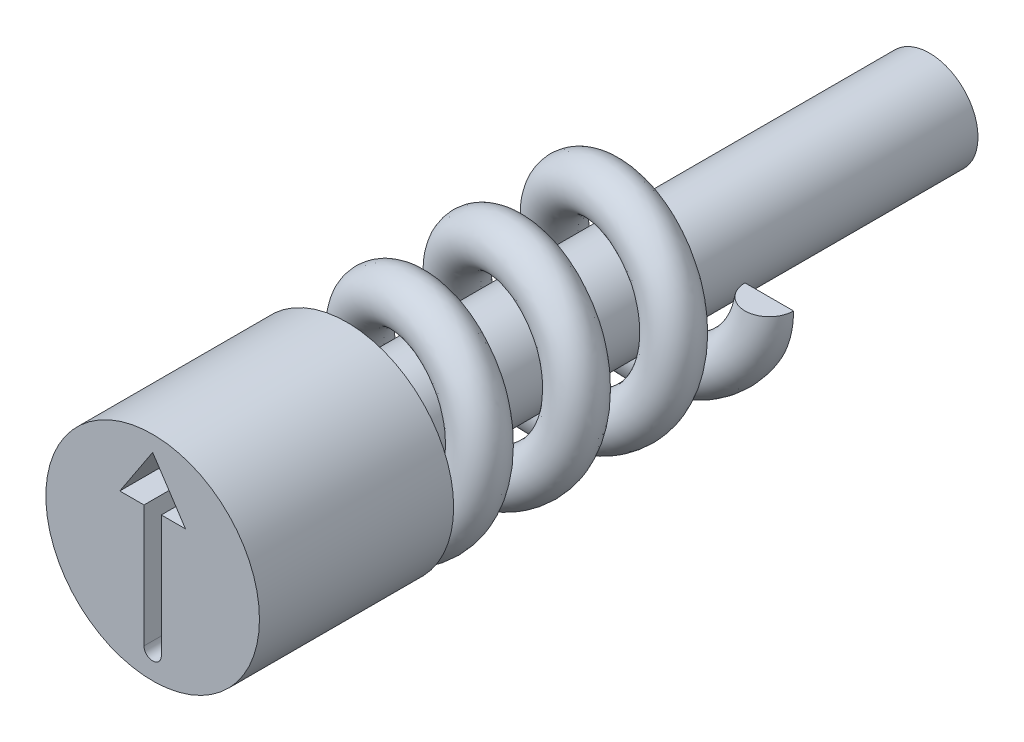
ISO-10303-21;
HEADER;
FILE_DESCRIPTION(('STEP AP214'),'2;1');
FILE_NAME('part.step','',(''),(''),'','','');
FILE_SCHEMA(('AUTOMOTIVE_DESIGN { 1 0 10303 214 1 1 1 1 }'));
ENDSEC;
DATA;
#1=APPLICATION_CONTEXT('core data for automotive mechanical design processes');
#2=APPLICATION_PROTOCOL_DEFINITION('international standard','automotive_design',2000,#1);
#3=PRODUCT_CONTEXT('',#1,'mechanical');
#4=PRODUCT('Part','Part','',(#3));
#5=PRODUCT_RELATED_PRODUCT_CATEGORY('part','',(#4));
#6=PRODUCT_DEFINITION_FORMATION('','',#4);
#7=PRODUCT_DEFINITION_CONTEXT('part definition',#1,'design');
#8=PRODUCT_DEFINITION('design','',#6,#7);
#9=PRODUCT_DEFINITION_SHAPE('','',#8);
#10=(LENGTH_UNIT() NAMED_UNIT(*) SI_UNIT(.MILLI.,.METRE.));
#11=(NAMED_UNIT(*) PLANE_ANGLE_UNIT() SI_UNIT($,.RADIAN.));
#12=(NAMED_UNIT(*) SI_UNIT($,.STERADIAN.) SOLID_ANGLE_UNIT());
#13=UNCERTAINTY_MEASURE_WITH_UNIT(LENGTH_MEASURE(1.E-05),#10,'distance_accuracy_value','');
#14=(GEOMETRIC_REPRESENTATION_CONTEXT(3) GLOBAL_UNCERTAINTY_ASSIGNED_CONTEXT((#13)) GLOBAL_UNIT_ASSIGNED_CONTEXT((#10,
#11,#12)) REPRESENTATION_CONTEXT('',''));
#15=CARTESIAN_POINT('',(0.,0.,0.));
#16=DIRECTION('',(0.,0.,1.));
#17=DIRECTION('',(1.,0.,0.));
#18=AXIS2_PLACEMENT_3D('',#15,#16,#17);
#19=CARTESIAN_POINT('',(0.85,0.,-5.75));
#20=DIRECTION('',(0.,-1.,0.));
#21=DIRECTION('',(0.,0.,-1.));
#22=AXIS2_PLACEMENT_3D('',#19,#20,#21);
#23=PLANE('',#22);
#24=CARTESIAN_POINT('',(0.85,0.,-5.5));
#25=DIRECTION('',(0.,1.,0.));
#26=DIRECTION('',(0.,0.,1.));
#27=AXIS2_PLACEMENT_3D('',#24,#25,#26);
#28=CIRCLE('',#27,0.25);
#29=CARTESIAN_POINT('',(0.6,-3.81647975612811E-13,-5.5));
#30=VERTEX_POINT('',#29);
#31=CARTESIAN_POINT('',(1.1,0.,-5.5));
#32=VERTEX_POINT('',#31);
#33=EDGE_CURVE('E88',#30,#32,#28,.T.);
#34=ORIENTED_EDGE('',*,*,#33,.T.);
#35=DIRECTION('',(-1.,0.,0.));
#36=VECTOR('',#35,1.);
#37=CARTESIAN_POINT('',(0.85,0.,-5.5));
#38=LINE('',#37,#36);
#39=EDGE_CURVE('E75',#32,#30,#38,.T.);
#40=ORIENTED_EDGE('',*,*,#39,.T.);
#41=EDGE_LOOP('',(#34,#40));
#42=FACE_BOUND('',#41,.T.);
#43=ADVANCED_FACE('F49',(#42),#23,.F.);
#44=CARTESIAN_POINT('',(-0.85,0.,-2.25));
#45=DIRECTION('',(0.,1.,0.));
#46=DIRECTION('',(-1.,0.,0.));
#47=AXIS2_PLACEMENT_3D('',#44,#45,#46);
#48=PLANE('',#47);
#49=DIRECTION('',(-1.,0.,0.));
#50=VECTOR('',#49,1.);
#51=CARTESIAN_POINT('',(-0.85,0.,-2.));
#52=LINE('',#51,#50);
#53=CARTESIAN_POINT('',(-0.6,0.,-2.));
#54=VERTEX_POINT('',#53);
#55=CARTESIAN_POINT('',(-1.1,0.,-2.));
#56=VERTEX_POINT('',#55);
#57=EDGE_CURVE('E69',#54,#56,#52,.T.);
#58=ORIENTED_EDGE('',*,*,#57,.F.);
#59=CARTESIAN_POINT('',(-0.85,0.,-2.));
#60=DIRECTION('',(0.,1.,0.));
#61=DIRECTION('',(-1.,0.,0.));
#62=AXIS2_PLACEMENT_3D('',#59,#60,#61);
#63=CIRCLE('',#62,0.25);
#64=EDGE_CURVE('E85',#54,#56,#63,.T.);
#65=ORIENTED_EDGE('',*,*,#64,.T.);
#66=EDGE_LOOP('',(#58,#65));
#67=FACE_BOUND('',#66,.T.);
#68=ADVANCED_FACE('F51',(#67),#48,.T.);
#69=CARTESIAN_POINT('',(0.85,0.,-5.25));
#70=CARTESIAN_POINT('',(0.85,-0.352081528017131,-5.1875));
#71=CARTESIAN_POINT('',(0.601040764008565,-0.601040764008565,-5.125));
#72=CARTESIAN_POINT('',(0.352081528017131,-0.85,-5.0625));
#73=CARTESIAN_POINT('',(0.,-0.85,-5.));
#74=CARTESIAN_POINT('',(-0.352081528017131,-0.85,-4.9375));
#75=CARTESIAN_POINT('',(-0.601040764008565,-0.601040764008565,-4.875));
#76=CARTESIAN_POINT('',(-0.85,-0.352081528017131,-4.8125));
#77=CARTESIAN_POINT('',(-0.85,0.,-4.75));
#78=CARTESIAN_POINT('',(-0.85,0.352081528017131,-4.6875));
#79=CARTESIAN_POINT('',(-0.601040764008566,0.601040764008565,-4.625));
#80=CARTESIAN_POINT('',(-0.352081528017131,0.85,-4.5625));
#81=CARTESIAN_POINT('',(0.,0.85,-4.5));
#82=CARTESIAN_POINT('',(0.352081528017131,0.85,-4.4375));
#83=CARTESIAN_POINT('',(0.601040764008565,0.601040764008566,-4.375));
#84=CARTESIAN_POINT('',(0.85,0.352081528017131,-4.3125));
#85=CARTESIAN_POINT('',(0.85,0.,-4.25));
#86=CARTESIAN_POINT('',(0.85,-0.352081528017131,-4.1875));
#87=CARTESIAN_POINT('',(0.601040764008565,-0.601040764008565,-4.125));
#88=CARTESIAN_POINT('',(0.352081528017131,-0.85,-4.0625));
#89=CARTESIAN_POINT('',(0.,-0.85,-4.));
#90=CARTESIAN_POINT('',(-0.352081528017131,-0.85,-3.9375));
#91=CARTESIAN_POINT('',(-0.601040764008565,-0.601040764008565,-3.875));
#92=CARTESIAN_POINT('',(-0.85,-0.352081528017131,-3.8125));
#93=CARTESIAN_POINT('',(-0.85,0.,-3.75));
#94=CARTESIAN_POINT('',(-0.85,0.352081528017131,-3.6875));
#95=CARTESIAN_POINT('',(-0.601040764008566,0.601040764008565,-3.625));
#96=CARTESIAN_POINT('',(-0.352081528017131,0.85,-3.5625));
#97=CARTESIAN_POINT('',(0.,0.85,-3.5));
#98=CARTESIAN_POINT('',(0.352081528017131,0.85,-3.4375));
#99=CARTESIAN_POINT('',(0.601040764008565,0.601040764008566,-3.375));
#100=CARTESIAN_POINT('',(0.85,0.352081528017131,-3.3125));
#101=CARTESIAN_POINT('',(0.85,0.,-3.25));
#102=CARTESIAN_POINT('',(0.85,-0.352081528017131,-3.1875));
#103=CARTESIAN_POINT('',(0.601040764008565,-0.601040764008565,-3.125));
#104=CARTESIAN_POINT('',(0.352081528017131,-0.85,-3.0625));
#105=CARTESIAN_POINT('',(0.,-0.85,-3.));
#106=CARTESIAN_POINT('',(-0.352081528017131,-0.85,-2.9375));
#107=CARTESIAN_POINT('',(-0.601040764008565,-0.601040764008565,-2.875));
#108=CARTESIAN_POINT('',(-0.85,-0.352081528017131,-2.8125));
#109=CARTESIAN_POINT('',(-0.85,0.,-2.75));
#110=CARTESIAN_POINT('',(-0.85,0.352081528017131,-2.6875));
#111=CARTESIAN_POINT('',(-0.601040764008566,0.601040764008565,-2.625));
#112=CARTESIAN_POINT('',(-0.352081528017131,0.85,-2.5625));
#113=CARTESIAN_POINT('',(0.,0.85,-2.5));
#114=CARTESIAN_POINT('',(0.352081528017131,0.85,-2.4375));
#115=CARTESIAN_POINT('',(0.601040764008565,0.601040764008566,-2.375));
#116=CARTESIAN_POINT('',(0.85,0.352081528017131,-2.3125));
#117=CARTESIAN_POINT('',(0.85,0.,-2.25));
#118=CARTESIAN_POINT('',(0.85,-0.352081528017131,-2.1875));
#119=CARTESIAN_POINT('',(0.601040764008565,-0.601040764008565,-2.125));
#120=CARTESIAN_POINT('',(0.352081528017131,-0.85,-2.0625));
#121=CARTESIAN_POINT('',(0.,-0.85,-2.));
#122=CARTESIAN_POINT('',(-0.352081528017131,-0.85,-1.9375));
#123=CARTESIAN_POINT('',(-0.601040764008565,-0.601040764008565,-1.875));
#124=CARTESIAN_POINT('',(-0.85,-0.352081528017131,-1.8125));
#125=CARTESIAN_POINT('',(-0.85,0.,-1.75));
#126=CARTESIAN_POINT('',(1.35,0.,-5.25));
#127=CARTESIAN_POINT('',(1.35,-0.559188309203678,-5.1875));
#128=CARTESIAN_POINT('',(0.954594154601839,-0.954594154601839,-5.125));
#129=CARTESIAN_POINT('',(0.559188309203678,-1.35,-5.0625));
#130=CARTESIAN_POINT('',(0.,-1.35,-5.));
#131=CARTESIAN_POINT('',(-0.559188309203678,-1.35,-4.9375));
#132=CARTESIAN_POINT('',(-0.954594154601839,-0.954594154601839,-4.875));
#133=CARTESIAN_POINT('',(-1.35,-0.559188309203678,-4.8125));
#134=CARTESIAN_POINT('',(-1.35,0.,-4.75));
#135=CARTESIAN_POINT('',(-1.35,0.559188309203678,-4.6875));
#136=CARTESIAN_POINT('',(-0.954594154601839,0.954594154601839,-4.625));
#137=CARTESIAN_POINT('',(-0.559188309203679,1.35,-4.5625));
#138=CARTESIAN_POINT('',(0.,1.35,-4.5));
#139=CARTESIAN_POINT('',(0.559188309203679,1.35,-4.4375));
#140=CARTESIAN_POINT('',(0.954594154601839,0.954594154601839,-4.375));
#141=CARTESIAN_POINT('',(1.35,0.559188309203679,-4.3125));
#142=CARTESIAN_POINT('',(1.35,0.,-4.25));
#143=CARTESIAN_POINT('',(1.35,-0.559188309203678,-4.1875));
#144=CARTESIAN_POINT('',(0.954594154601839,-0.954594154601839,-4.125));
#145=CARTESIAN_POINT('',(0.559188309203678,-1.35,-4.0625));
#146=CARTESIAN_POINT('',(0.,-1.35,-4.));
#147=CARTESIAN_POINT('',(-0.559188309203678,-1.35,-3.9375));
#148=CARTESIAN_POINT('',(-0.954594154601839,-0.954594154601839,-3.875));
#149=CARTESIAN_POINT('',(-1.35,-0.559188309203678,-3.8125));
#150=CARTESIAN_POINT('',(-1.35,0.,-3.75));
#151=CARTESIAN_POINT('',(-1.35,0.559188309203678,-3.6875));
#152=CARTESIAN_POINT('',(-0.954594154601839,0.954594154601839,-3.625));
#153=CARTESIAN_POINT('',(-0.559188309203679,1.35,-3.5625));
#154=CARTESIAN_POINT('',(0.,1.35,-3.5));
#155=CARTESIAN_POINT('',(0.559188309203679,1.35,-3.4375));
#156=CARTESIAN_POINT('',(0.954594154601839,0.954594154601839,-3.375));
#157=CARTESIAN_POINT('',(1.35,0.559188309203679,-3.3125));
#158=CARTESIAN_POINT('',(1.35,0.,-3.25));
#159=CARTESIAN_POINT('',(1.35,-0.559188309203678,-3.1875));
#160=CARTESIAN_POINT('',(0.954594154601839,-0.954594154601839,-3.125));
#161=CARTESIAN_POINT('',(0.559188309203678,-1.35,-3.0625));
#162=CARTESIAN_POINT('',(0.,-1.35,-3.));
#163=CARTESIAN_POINT('',(-0.559188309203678,-1.35,-2.9375));
#164=CARTESIAN_POINT('',(-0.954594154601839,-0.954594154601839,-2.875));
#165=CARTESIAN_POINT('',(-1.35,-0.559188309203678,-2.8125));
#166=CARTESIAN_POINT('',(-1.35,0.,-2.75));
#167=CARTESIAN_POINT('',(-1.35,0.559188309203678,-2.6875));
#168=CARTESIAN_POINT('',(-0.954594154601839,0.954594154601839,-2.625));
#169=CARTESIAN_POINT('',(-0.559188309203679,1.35,-2.5625));
#170=CARTESIAN_POINT('',(0.,1.35,-2.5));
#171=CARTESIAN_POINT('',(0.559188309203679,1.35,-2.4375));
#172=CARTESIAN_POINT('',(0.954594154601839,0.954594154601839,-2.375));
#173=CARTESIAN_POINT('',(1.35,0.559188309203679,-2.3125));
#174=CARTESIAN_POINT('',(1.35,0.,-2.25));
#175=CARTESIAN_POINT('',(1.35,-0.559188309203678,-2.1875));
#176=CARTESIAN_POINT('',(0.954594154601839,-0.954594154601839,-2.125));
#177=CARTESIAN_POINT('',(0.559188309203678,-1.35,-2.0625));
#178=CARTESIAN_POINT('',(0.,-1.35,-2.));
#179=CARTESIAN_POINT('',(-0.559188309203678,-1.35,-1.9375));
#180=CARTESIAN_POINT('',(-0.954594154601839,-0.954594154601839,-1.875));
#181=CARTESIAN_POINT('',(-1.35,-0.559188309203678,-1.8125));
#182=CARTESIAN_POINT('',(-1.35,0.,-1.75));
#183=CARTESIAN_POINT('',(1.35,0.,-5.75));
#184=CARTESIAN_POINT('',(1.35,-0.559188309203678,-5.6875));
#185=CARTESIAN_POINT('',(0.954594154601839,-0.954594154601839,-5.625));
#186=CARTESIAN_POINT('',(0.559188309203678,-1.35,-5.5625));
#187=CARTESIAN_POINT('',(0.,-1.35,-5.5));
#188=CARTESIAN_POINT('',(-0.559188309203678,-1.35,-5.4375));
#189=CARTESIAN_POINT('',(-0.954594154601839,-0.954594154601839,-5.375));
#190=CARTESIAN_POINT('',(-1.35,-0.559188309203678,-5.3125));
#191=CARTESIAN_POINT('',(-1.35,0.,-5.25));
#192=CARTESIAN_POINT('',(-1.35,0.559188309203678,-5.1875));
#193=CARTESIAN_POINT('',(-0.954594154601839,0.954594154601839,-5.125));
#194=CARTESIAN_POINT('',(-0.559188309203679,1.35,-5.0625));
#195=CARTESIAN_POINT('',(0.,1.35,-5.));
#196=CARTESIAN_POINT('',(0.559188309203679,1.35,-4.9375));
#197=CARTESIAN_POINT('',(0.954594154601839,0.954594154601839,-4.875));
#198=CARTESIAN_POINT('',(1.35,0.559188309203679,-4.8125));
#199=CARTESIAN_POINT('',(1.35,0.,-4.75));
#200=CARTESIAN_POINT('',(1.35,-0.559188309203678,-4.6875));
#201=CARTESIAN_POINT('',(0.954594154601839,-0.954594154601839,-4.625));
#202=CARTESIAN_POINT('',(0.559188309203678,-1.35,-4.5625));
#203=CARTESIAN_POINT('',(0.,-1.35,-4.5));
#204=CARTESIAN_POINT('',(-0.559188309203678,-1.35,-4.4375));
#205=CARTESIAN_POINT('',(-0.954594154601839,-0.954594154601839,-4.375));
#206=CARTESIAN_POINT('',(-1.35,-0.559188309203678,-4.3125));
#207=CARTESIAN_POINT('',(-1.35,0.,-4.25));
#208=CARTESIAN_POINT('',(-1.35,0.559188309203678,-4.1875));
#209=CARTESIAN_POINT('',(-0.954594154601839,0.954594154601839,-4.125));
#210=CARTESIAN_POINT('',(-0.559188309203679,1.35,-4.0625));
#211=CARTESIAN_POINT('',(0.,1.35,-4.));
#212=CARTESIAN_POINT('',(0.559188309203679,1.35,-3.9375));
#213=CARTESIAN_POINT('',(0.954594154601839,0.954594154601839,-3.875));
#214=CARTESIAN_POINT('',(1.35,0.559188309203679,-3.8125));
#215=CARTESIAN_POINT('',(1.35,0.,-3.75));
#216=CARTESIAN_POINT('',(1.35,-0.559188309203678,-3.6875));
#217=CARTESIAN_POINT('',(0.954594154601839,-0.954594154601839,-3.625));
#218=CARTESIAN_POINT('',(0.559188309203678,-1.35,-3.5625));
#219=CARTESIAN_POINT('',(0.,-1.35,-3.5));
#220=CARTESIAN_POINT('',(-0.559188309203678,-1.35,-3.4375));
#221=CARTESIAN_POINT('',(-0.954594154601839,-0.954594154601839,-3.375));
#222=CARTESIAN_POINT('',(-1.35,-0.559188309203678,-3.3125));
#223=CARTESIAN_POINT('',(-1.35,0.,-3.25));
#224=CARTESIAN_POINT('',(-1.35,0.559188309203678,-3.1875));
#225=CARTESIAN_POINT('',(-0.954594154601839,0.954594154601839,-3.125));
#226=CARTESIAN_POINT('',(-0.559188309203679,1.35,-3.0625));
#227=CARTESIAN_POINT('',(0.,1.35,-3.));
#228=CARTESIAN_POINT('',(0.559188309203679,1.35,-2.9375));
#229=CARTESIAN_POINT('',(0.954594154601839,0.954594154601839,-2.875));
#230=CARTESIAN_POINT('',(1.35,0.559188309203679,-2.8125));
#231=CARTESIAN_POINT('',(1.35,0.,-2.75));
#232=CARTESIAN_POINT('',(1.35,-0.559188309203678,-2.6875));
#233=CARTESIAN_POINT('',(0.954594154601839,-0.954594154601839,-2.625));
#234=CARTESIAN_POINT('',(0.559188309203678,-1.35,-2.5625));
#235=CARTESIAN_POINT('',(0.,-1.35,-2.5));
#236=CARTESIAN_POINT('',(-0.559188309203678,-1.35,-2.4375));
#237=CARTESIAN_POINT('',(-0.954594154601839,-0.954594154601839,-2.375));
#238=CARTESIAN_POINT('',(-1.35,-0.559188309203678,-2.3125));
#239=CARTESIAN_POINT('',(-1.35,0.,-2.25));
#240=CARTESIAN_POINT('',(0.85,0.,-5.75));
#241=CARTESIAN_POINT('',(0.85,-0.352081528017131,-5.6875));
#242=CARTESIAN_POINT('',(0.601040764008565,-0.601040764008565,-5.625));
#243=CARTESIAN_POINT('',(0.352081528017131,-0.85,-5.5625));
#244=CARTESIAN_POINT('',(0.,-0.85,-5.5));
#245=CARTESIAN_POINT('',(-0.352081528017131,-0.85,-5.4375));
#246=CARTESIAN_POINT('',(-0.601040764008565,-0.601040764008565,-5.375));
#247=CARTESIAN_POINT('',(-0.85,-0.352081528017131,-5.3125));
#248=CARTESIAN_POINT('',(-0.85,0.,-5.25));
#249=CARTESIAN_POINT('',(-0.85,0.352081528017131,-5.1875));
#250=CARTESIAN_POINT('',(-0.601040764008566,0.601040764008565,-5.125));
#251=CARTESIAN_POINT('',(-0.352081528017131,0.85,-5.0625));
#252=CARTESIAN_POINT('',(0.,0.85,-5.));
#253=CARTESIAN_POINT('',(0.352081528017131,0.85,-4.9375));
#254=CARTESIAN_POINT('',(0.601040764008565,0.601040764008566,-4.875));
#255=CARTESIAN_POINT('',(0.85,0.352081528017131,-4.8125));
#256=CARTESIAN_POINT('',(0.85,0.,-4.75));
#257=CARTESIAN_POINT('',(0.85,-0.352081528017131,-4.6875));
#258=CARTESIAN_POINT('',(0.601040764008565,-0.601040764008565,-4.625));
#259=CARTESIAN_POINT('',(0.352081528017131,-0.85,-4.5625));
#260=CARTESIAN_POINT('',(0.,-0.85,-4.5));
#261=CARTESIAN_POINT('',(-0.352081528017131,-0.85,-4.4375));
#262=CARTESIAN_POINT('',(-0.601040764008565,-0.601040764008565,-4.375));
#263=CARTESIAN_POINT('',(-0.85,-0.352081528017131,-4.3125));
#264=CARTESIAN_POINT('',(-0.85,0.,-4.25));
#265=CARTESIAN_POINT('',(-0.85,0.352081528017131,-4.1875));
#266=CARTESIAN_POINT('',(-0.601040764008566,0.601040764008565,-4.125));
#267=CARTESIAN_POINT('',(-0.352081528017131,0.85,-4.0625));
#268=CARTESIAN_POINT('',(0.,0.85,-4.));
#269=CARTESIAN_POINT('',(0.352081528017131,0.85,-3.9375));
#270=CARTESIAN_POINT('',(0.601040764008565,0.601040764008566,-3.875));
#271=CARTESIAN_POINT('',(0.85,0.352081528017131,-3.8125));
#272=CARTESIAN_POINT('',(0.85,0.,-3.75));
#273=CARTESIAN_POINT('',(0.85,-0.352081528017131,-3.6875));
#274=CARTESIAN_POINT('',(0.601040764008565,-0.601040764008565,-3.625));
#275=CARTESIAN_POINT('',(0.352081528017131,-0.85,-3.5625));
#276=CARTESIAN_POINT('',(0.,-0.85,-3.5));
#277=CARTESIAN_POINT('',(-0.352081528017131,-0.85,-3.4375));
#278=CARTESIAN_POINT('',(-0.601040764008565,-0.601040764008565,-3.375));
#279=CARTESIAN_POINT('',(-0.85,-0.352081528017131,-3.3125));
#280=CARTESIAN_POINT('',(-0.85,0.,-3.25));
#281=CARTESIAN_POINT('',(-0.85,0.352081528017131,-3.1875));
#282=CARTESIAN_POINT('',(-0.601040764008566,0.601040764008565,-3.125));
#283=CARTESIAN_POINT('',(-0.352081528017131,0.85,-3.0625));
#284=CARTESIAN_POINT('',(0.,0.85,-3.));
#285=CARTESIAN_POINT('',(0.352081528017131,0.85,-2.9375));
#286=CARTESIAN_POINT('',(0.601040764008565,0.601040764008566,-2.875));
#287=CARTESIAN_POINT('',(0.85,0.352081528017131,-2.8125));
#288=CARTESIAN_POINT('',(0.85,0.,-2.75));
#289=CARTESIAN_POINT('',(0.85,-0.352081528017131,-2.6875));
#290=CARTESIAN_POINT('',(0.601040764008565,-0.601040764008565,-2.625));
#291=CARTESIAN_POINT('',(0.352081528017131,-0.85,-2.5625));
#292=CARTESIAN_POINT('',(0.,-0.85,-2.5));
#293=CARTESIAN_POINT('',(-0.352081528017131,-0.85,-2.4375));
#294=CARTESIAN_POINT('',(-0.601040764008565,-0.601040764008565,-2.375));
#295=CARTESIAN_POINT('',(-0.85,-0.352081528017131,-2.3125));
#296=CARTESIAN_POINT('',(-0.85,0.,-2.25));
#297=CARTESIAN_POINT('',(0.35,0.,-5.75));
#298=CARTESIAN_POINT('',(0.35,-0.144974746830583,-5.6875));
#299=CARTESIAN_POINT('',(0.247487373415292,-0.247487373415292,-5.625));
#300=CARTESIAN_POINT('',(0.144974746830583,-0.35,-5.5625));
#301=CARTESIAN_POINT('',(0.,-0.35,-5.5));
#302=CARTESIAN_POINT('',(-0.144974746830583,-0.35,-5.4375));
#303=CARTESIAN_POINT('',(-0.247487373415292,-0.247487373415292,-5.375));
#304=CARTESIAN_POINT('',(-0.35,-0.144974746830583,-5.3125));
#305=CARTESIAN_POINT('',(-0.35,0.,-5.25));
#306=CARTESIAN_POINT('',(-0.35,0.144974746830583,-5.1875));
#307=CARTESIAN_POINT('',(-0.247487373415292,0.247487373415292,-5.125));
#308=CARTESIAN_POINT('',(-0.144974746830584,0.35,-5.0625));
#309=CARTESIAN_POINT('',(0.,0.35,-5.));
#310=CARTESIAN_POINT('',(0.144974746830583,0.35,-4.9375));
#311=CARTESIAN_POINT('',(0.247487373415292,0.247487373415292,-4.875));
#312=CARTESIAN_POINT('',(0.35,0.144974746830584,-4.8125));
#313=CARTESIAN_POINT('',(0.35,0.,-4.75));
#314=CARTESIAN_POINT('',(0.35,-0.144974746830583,-4.6875));
#315=CARTESIAN_POINT('',(0.247487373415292,-0.247487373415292,-4.625));
#316=CARTESIAN_POINT('',(0.144974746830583,-0.35,-4.5625));
#317=CARTESIAN_POINT('',(0.,-0.35,-4.5));
#318=CARTESIAN_POINT('',(-0.144974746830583,-0.35,-4.4375));
#319=CARTESIAN_POINT('',(-0.247487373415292,-0.247487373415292,-4.375));
#320=CARTESIAN_POINT('',(-0.35,-0.144974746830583,-4.3125));
#321=CARTESIAN_POINT('',(-0.35,0.,-4.25));
#322=CARTESIAN_POINT('',(-0.35,0.144974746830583,-4.1875));
#323=CARTESIAN_POINT('',(-0.247487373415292,0.247487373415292,-4.125));
#324=CARTESIAN_POINT('',(-0.144974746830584,0.35,-4.0625));
#325=CARTESIAN_POINT('',(0.,0.35,-4.));
#326=CARTESIAN_POINT('',(0.144974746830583,0.35,-3.9375));
#327=CARTESIAN_POINT('',(0.247487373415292,0.247487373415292,-3.875));
#328=CARTESIAN_POINT('',(0.35,0.144974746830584,-3.8125));
#329=CARTESIAN_POINT('',(0.35,0.,-3.75));
#330=CARTESIAN_POINT('',(0.35,-0.144974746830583,-3.6875));
#331=CARTESIAN_POINT('',(0.247487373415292,-0.247487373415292,-3.625));
#332=CARTESIAN_POINT('',(0.144974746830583,-0.35,-3.5625));
#333=CARTESIAN_POINT('',(0.,-0.35,-3.5));
#334=CARTESIAN_POINT('',(-0.144974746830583,-0.35,-3.4375));
#335=CARTESIAN_POINT('',(-0.247487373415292,-0.247487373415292,-3.375));
#336=CARTESIAN_POINT('',(-0.35,-0.144974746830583,-3.3125));
#337=CARTESIAN_POINT('',(-0.35,0.,-3.25));
#338=CARTESIAN_POINT('',(-0.35,0.144974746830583,-3.1875));
#339=CARTESIAN_POINT('',(-0.247487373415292,0.247487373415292,-3.125));
#340=CARTESIAN_POINT('',(-0.144974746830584,0.35,-3.0625));
#341=CARTESIAN_POINT('',(0.,0.35,-3.));
#342=CARTESIAN_POINT('',(0.144974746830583,0.35,-2.9375));
#343=CARTESIAN_POINT('',(0.247487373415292,0.247487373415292,-2.875));
#344=CARTESIAN_POINT('',(0.35,0.144974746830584,-2.8125));
#345=CARTESIAN_POINT('',(0.35,0.,-2.75));
#346=CARTESIAN_POINT('',(0.35,-0.144974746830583,-2.6875));
#347=CARTESIAN_POINT('',(0.247487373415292,-0.247487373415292,-2.625));
#348=CARTESIAN_POINT('',(0.144974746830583,-0.35,-2.5625));
#349=CARTESIAN_POINT('',(0.,-0.35,-2.5));
#350=CARTESIAN_POINT('',(-0.144974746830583,-0.35,-2.4375));
#351=CARTESIAN_POINT('',(-0.247487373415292,-0.247487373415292,-2.375));
#352=CARTESIAN_POINT('',(-0.35,-0.144974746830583,-2.3125));
#353=CARTESIAN_POINT('',(-0.35,0.,-2.25));
#354=CARTESIAN_POINT('',(0.35,0.,-5.25));
#355=CARTESIAN_POINT('',(0.35,-0.144974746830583,-5.1875));
#356=CARTESIAN_POINT('',(0.247487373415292,-0.247487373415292,-5.125));
#357=CARTESIAN_POINT('',(0.144974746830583,-0.35,-5.0625));
#358=CARTESIAN_POINT('',(0.,-0.35,-5.));
#359=CARTESIAN_POINT('',(-0.144974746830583,-0.35,-4.9375));
#360=CARTESIAN_POINT('',(-0.247487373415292,-0.247487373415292,-4.875));
#361=CARTESIAN_POINT('',(-0.35,-0.144974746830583,-4.8125));
#362=CARTESIAN_POINT('',(-0.35,0.,-4.75));
#363=CARTESIAN_POINT('',(-0.35,0.144974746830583,-4.6875));
#364=CARTESIAN_POINT('',(-0.247487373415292,0.247487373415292,-4.625));
#365=CARTESIAN_POINT('',(-0.144974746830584,0.35,-4.5625));
#366=CARTESIAN_POINT('',(0.,0.35,-4.5));
#367=CARTESIAN_POINT('',(0.144974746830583,0.35,-4.4375));
#368=CARTESIAN_POINT('',(0.247487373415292,0.247487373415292,-4.375));
#369=CARTESIAN_POINT('',(0.35,0.144974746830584,-4.3125));
#370=CARTESIAN_POINT('',(0.35,0.,-4.25));
#371=CARTESIAN_POINT('',(0.35,-0.144974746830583,-4.1875));
#372=CARTESIAN_POINT('',(0.247487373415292,-0.247487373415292,-4.125));
#373=CARTESIAN_POINT('',(0.144974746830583,-0.35,-4.0625));
#374=CARTESIAN_POINT('',(0.,-0.35,-4.));
#375=CARTESIAN_POINT('',(-0.144974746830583,-0.35,-3.9375));
#376=CARTESIAN_POINT('',(-0.247487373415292,-0.247487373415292,-3.875));
#377=CARTESIAN_POINT('',(-0.35,-0.144974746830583,-3.8125));
#378=CARTESIAN_POINT('',(-0.35,0.,-3.75));
#379=CARTESIAN_POINT('',(-0.35,0.144974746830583,-3.6875));
#380=CARTESIAN_POINT('',(-0.247487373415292,0.247487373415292,-3.625));
#381=CARTESIAN_POINT('',(-0.144974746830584,0.35,-3.5625));
#382=CARTESIAN_POINT('',(0.,0.35,-3.5));
#383=CARTESIAN_POINT('',(0.144974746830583,0.35,-3.4375));
#384=CARTESIAN_POINT('',(0.247487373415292,0.247487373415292,-3.375));
#385=CARTESIAN_POINT('',(0.35,0.144974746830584,-3.3125));
#386=CARTESIAN_POINT('',(0.35,0.,-3.25));
#387=CARTESIAN_POINT('',(0.35,-0.144974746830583,-3.1875));
#388=CARTESIAN_POINT('',(0.247487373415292,-0.247487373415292,-3.125));
#389=CARTESIAN_POINT('',(0.144974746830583,-0.35,-3.0625));
#390=CARTESIAN_POINT('',(0.,-0.35,-3.));
#391=CARTESIAN_POINT('',(-0.144974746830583,-0.35,-2.9375));
#392=CARTESIAN_POINT('',(-0.247487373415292,-0.247487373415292,-2.875));
#393=CARTESIAN_POINT('',(-0.35,-0.144974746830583,-2.8125));
#394=CARTESIAN_POINT('',(-0.35,0.,-2.75));
#395=CARTESIAN_POINT('',(-0.35,0.144974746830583,-2.6875));
#396=CARTESIAN_POINT('',(-0.247487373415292,0.247487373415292,-2.625));
#397=CARTESIAN_POINT('',(-0.144974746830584,0.35,-2.5625));
#398=CARTESIAN_POINT('',(0.,0.35,-2.5));
#399=CARTESIAN_POINT('',(0.144974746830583,0.35,-2.4375));
#400=CARTESIAN_POINT('',(0.247487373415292,0.247487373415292,-2.375));
#401=CARTESIAN_POINT('',(0.35,0.144974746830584,-2.3125));
#402=CARTESIAN_POINT('',(0.35,0.,-2.25));
#403=CARTESIAN_POINT('',(0.35,-0.144974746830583,-2.1875));
#404=CARTESIAN_POINT('',(0.247487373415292,-0.247487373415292,-2.125));
#405=CARTESIAN_POINT('',(0.144974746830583,-0.35,-2.0625));
#406=CARTESIAN_POINT('',(0.,-0.35,-2.));
#407=CARTESIAN_POINT('',(-0.144974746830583,-0.35,-1.9375));
#408=CARTESIAN_POINT('',(-0.247487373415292,-0.247487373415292,-1.875));
#409=CARTESIAN_POINT('',(-0.35,-0.144974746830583,-1.8125));
#410=CARTESIAN_POINT('',(-0.35,0.,-1.75));
#411=CARTESIAN_POINT('',(0.85,0.,-5.25));
#412=CARTESIAN_POINT('',(0.85,-0.352081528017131,-5.1875));
#413=CARTESIAN_POINT('',(0.601040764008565,-0.601040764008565,-5.125));
#414=CARTESIAN_POINT('',(0.352081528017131,-0.85,-5.0625));
#415=CARTESIAN_POINT('',(0.,-0.85,-5.));
#416=CARTESIAN_POINT('',(-0.352081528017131,-0.85,-4.9375));
#417=CARTESIAN_POINT('',(-0.601040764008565,-0.601040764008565,-4.875));
#418=CARTESIAN_POINT('',(-0.85,-0.352081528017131,-4.8125));
#419=CARTESIAN_POINT('',(-0.85,0.,-4.75));
#420=CARTESIAN_POINT('',(-0.85,0.352081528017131,-4.6875));
#421=CARTESIAN_POINT('',(-0.601040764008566,0.601040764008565,-4.625));
#422=CARTESIAN_POINT('',(-0.352081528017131,0.85,-4.5625));
#423=CARTESIAN_POINT('',(0.,0.85,-4.5));
#424=CARTESIAN_POINT('',(0.352081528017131,0.85,-4.4375));
#425=CARTESIAN_POINT('',(0.601040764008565,0.601040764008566,-4.375));
#426=CARTESIAN_POINT('',(0.85,0.352081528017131,-4.3125));
#427=CARTESIAN_POINT('',(0.85,0.,-4.25));
#428=CARTESIAN_POINT('',(0.85,-0.352081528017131,-4.1875));
#429=CARTESIAN_POINT('',(0.601040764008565,-0.601040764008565,-4.125));
#430=CARTESIAN_POINT('',(0.352081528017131,-0.85,-4.0625));
#431=CARTESIAN_POINT('',(0.,-0.85,-4.));
#432=CARTESIAN_POINT('',(-0.352081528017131,-0.85,-3.9375));
#433=CARTESIAN_POINT('',(-0.601040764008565,-0.601040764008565,-3.875));
#434=CARTESIAN_POINT('',(-0.85,-0.352081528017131,-3.8125));
#435=CARTESIAN_POINT('',(-0.85,0.,-3.75));
#436=CARTESIAN_POINT('',(-0.85,0.352081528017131,-3.6875));
#437=CARTESIAN_POINT('',(-0.601040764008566,0.601040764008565,-3.625));
#438=CARTESIAN_POINT('',(-0.352081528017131,0.85,-3.5625));
#439=CARTESIAN_POINT('',(0.,0.85,-3.5));
#440=CARTESIAN_POINT('',(0.352081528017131,0.85,-3.4375));
#441=CARTESIAN_POINT('',(0.601040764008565,0.601040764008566,-3.375));
#442=CARTESIAN_POINT('',(0.85,0.352081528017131,-3.3125));
#443=CARTESIAN_POINT('',(0.85,0.,-3.25));
#444=CARTESIAN_POINT('',(0.85,-0.352081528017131,-3.1875));
#445=CARTESIAN_POINT('',(0.601040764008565,-0.601040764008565,-3.125));
#446=CARTESIAN_POINT('',(0.352081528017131,-0.85,-3.0625));
#447=CARTESIAN_POINT('',(0.,-0.85,-3.));
#448=CARTESIAN_POINT('',(-0.352081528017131,-0.85,-2.9375));
#449=CARTESIAN_POINT('',(-0.601040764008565,-0.601040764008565,-2.875));
#450=CARTESIAN_POINT('',(-0.85,-0.352081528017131,-2.8125));
#451=CARTESIAN_POINT('',(-0.85,0.,-2.75));
#452=CARTESIAN_POINT('',(-0.85,0.352081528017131,-2.6875));
#453=CARTESIAN_POINT('',(-0.601040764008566,0.601040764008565,-2.625));
#454=CARTESIAN_POINT('',(-0.352081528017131,0.85,-2.5625));
#455=CARTESIAN_POINT('',(0.,0.85,-2.5));
#456=CARTESIAN_POINT('',(0.352081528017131,0.85,-2.4375));
#457=CARTESIAN_POINT('',(0.601040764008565,0.601040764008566,-2.375));
#458=CARTESIAN_POINT('',(0.85,0.352081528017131,-2.3125));
#459=CARTESIAN_POINT('',(0.85,0.,-2.25));
#460=CARTESIAN_POINT('',(0.85,-0.352081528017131,-2.1875));
#461=CARTESIAN_POINT('',(0.601040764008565,-0.601040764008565,-2.125));
#462=CARTESIAN_POINT('',(0.352081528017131,-0.85,-2.0625));
#463=CARTESIAN_POINT('',(0.,-0.85,-2.));
#464=CARTESIAN_POINT('',(-0.352081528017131,-0.85,-1.9375));
#465=CARTESIAN_POINT('',(-0.601040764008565,-0.601040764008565,-1.875));
#466=CARTESIAN_POINT('',(-0.85,-0.352081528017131,-1.8125));
#467=CARTESIAN_POINT('',(-0.85,0.,-1.75));
#468=(BOUNDED_SURFACE() B_SPLINE_SURFACE(3,2,((#69,#70,#71,#72,#73,#74,#75,#76,#77,#78,#79,#80,
#81,#82,#83,#84,#85,#86,#87,#88,#89,#90,#91,#92,#93,#94,#95,#96,#97,#98,#99,#100,#101,#102,#103,
#104,#105,#106,#107,#108,#109,#110,#111,#112,#113,#114,#115,#116,#117,#118,#119,#120,#121,#122,
#123,#124,#125),(#126,#127,#128,#129,#130,#131,#132,#133,#134,#135,#136,#137,#138,#139,#140,
#141,#142,#143,#144,#145,#146,#147,#148,#149,#150,#151,#152,#153,#154,#155,#156,#157,#158,#159,
#160,#161,#162,#163,#164,#165,#166,#167,#168,#169,#170,#171,#172,#173,#174,#175,#176,#177,#178,
#179,#180,#181,#182),(#183,#184,#185,#186,#187,#188,#189,#190,#191,#192,#193,#194,#195,#196,
#197,#198,#199,#200,#201,#202,#203,#204,#205,#206,#207,#208,#209,#210,#211,#212,#213,#214,#215,
#216,#217,#218,#219,#220,#221,#222,#223,#224,#225,#226,#227,#228,#229,#230,#231,#232,#233,#234,
#235,#236,#237,#238,#239),(#240,#241,#242,#243,#244,#245,#246,#247,#248,#249,#250,#251,#252,
#253,#254,#255,#256,#257,#258,#259,#260,#261,#262,#263,#264,#265,#266,#267,#268,#269,#270,#271,
#272,#273,#274,#275,#276,#277,#278,#279,#280,#281,#282,#283,#284,#285,#286,#287,#288,#289,#290,
#291,#292,#293,#294,#295,#296),(#297,#298,#299,#300,#301,#302,#303,#304,#305,#306,#307,#308,
#309,#310,#311,#312,#313,#314,#315,#316,#317,#318,#319,#320,#321,#322,#323,#324,#325,#326,#327,
#328,#329,#330,#331,#332,#333,#334,#335,#336,#337,#338,#339,#340,#341,#342,#343,#344,#345,#346,
#347,#348,#349,#350,#351,#352,#353),(#354,#355,#356,#357,#358,#359,#360,#361,#362,#363,#364,
#365,#366,#367,#368,#369,#370,#371,#372,#373,#374,#375,#376,#377,#378,#379,#380,#381,#382,#383,
#384,#385,#386,#387,#388,#389,#390,#391,#392,#393,#394,#395,#396,#397,#398,#399,#400,#401,#402,
#403,#404,#405,#406,#407,#408,#409,#410),(#411,#412,#413,#414,#415,#416,#417,#418,#419,#420,
#421,#422,#423,#424,#425,#426,#427,#428,#429,#430,#431,#432,#433,#434,#435,#436,#437,#438,#439,
#440,#441,#442,#443,#444,#445,#446,#447,#448,#449,#450,#451,#452,#453,#454,#455,#456,#457,#458,
#459,#460,#461,#462,#463,#464,#465,#466,#467)),.UNSPECIFIED.,.T.,.F.,
.F.) B_SPLINE_SURFACE_WITH_KNOTS((4,3,4),(3,2,2,2,2,2,2,2,2,2,2,2,2,2,2,2,2,2,2,2,2,2,2,2,2,2,2,
2,3),(0.,0.5,1.),(0.,0.03125,0.0625,0.09375,0.125,0.15625,0.1875,0.21875,0.25,0.28125,0.3125,
0.34375,0.375,0.40625,0.4375,0.46875,0.5,0.53125,0.5625,0.59375,0.625,0.65625,0.6875,0.71875,
0.75,0.78125,0.8125,0.84375,0.875),
.UNSPECIFIED.) GEOMETRIC_REPRESENTATION_ITEM() RATIONAL_B_SPLINE_SURFACE(((1.,0.923879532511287,
1.,0.923879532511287,1.,0.923879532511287,1.,0.923879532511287,1.,0.923879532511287,1.,
0.923879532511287,1.,0.923879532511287,1.,0.923879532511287,1.,0.923879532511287,1.,
0.923879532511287,1.,0.923879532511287,1.,0.923879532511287,1.,0.923879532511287,1.,
0.923879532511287,1.,0.923879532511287,1.,0.923879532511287,1.,0.923879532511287,1.,
0.923879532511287,1.,0.923879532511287,1.,0.923879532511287,1.,0.923879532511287,1.,
0.923879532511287,1.,0.923879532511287,1.,0.923879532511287,1.,0.923879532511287,1.,
0.923879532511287,1.,0.923879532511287,1.,0.923879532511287,1.),(0.333333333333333,
0.307959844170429,0.333333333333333,0.307959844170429,0.333333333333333,0.307959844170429,
0.333333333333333,0.307959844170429,0.333333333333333,0.307959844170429,0.333333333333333,
0.307959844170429,0.333333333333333,0.307959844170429,0.333333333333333,0.307959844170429,
0.333333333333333,0.307959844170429,0.333333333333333,0.307959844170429,0.333333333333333,
0.307959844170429,0.333333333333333,0.307959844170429,0.333333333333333,0.307959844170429,
0.333333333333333,0.307959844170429,0.333333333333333,0.307959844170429,0.333333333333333,
0.307959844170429,0.333333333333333,0.307959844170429,0.333333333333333,0.307959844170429,
0.333333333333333,0.307959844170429,0.333333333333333,0.307959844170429,0.333333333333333,
0.307959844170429,0.333333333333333,0.307959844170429,0.333333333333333,0.307959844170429,
0.333333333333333,0.307959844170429,0.333333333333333,0.307959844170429,0.333333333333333,
0.307959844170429,0.333333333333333,0.307959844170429,0.333333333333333,0.307959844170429,
0.333333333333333),(0.333333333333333,0.307959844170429,0.333333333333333,0.307959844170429,
0.333333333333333,0.307959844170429,0.333333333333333,0.307959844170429,0.333333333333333,
0.307959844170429,0.333333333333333,0.307959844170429,0.333333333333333,0.307959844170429,
0.333333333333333,0.307959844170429,0.333333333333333,0.307959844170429,0.333333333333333,
0.307959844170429,0.333333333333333,0.307959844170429,0.333333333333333,0.307959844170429,
0.333333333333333,0.307959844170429,0.333333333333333,0.307959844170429,0.333333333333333,
0.307959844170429,0.333333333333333,0.307959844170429,0.333333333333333,0.307959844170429,
0.333333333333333,0.307959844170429,0.333333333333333,0.307959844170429,0.333333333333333,
0.307959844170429,0.333333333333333,0.307959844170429,0.333333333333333,0.307959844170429,
0.333333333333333,0.307959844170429,0.333333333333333,0.307959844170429,0.333333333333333,
0.307959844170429,0.333333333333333,0.307959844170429,0.333333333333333,0.307959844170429,
0.333333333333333,0.307959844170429,0.333333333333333),(1.,0.923879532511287,1.,
0.923879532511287,1.,0.923879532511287,1.,0.923879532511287,1.,0.923879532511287,1.,
0.923879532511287,1.,0.923879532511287,1.,0.923879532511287,1.,0.923879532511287,1.,
0.923879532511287,1.,0.923879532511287,1.,0.923879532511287,1.,0.923879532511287,1.,
0.923879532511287,1.,0.923879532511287,1.,0.923879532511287,1.,0.923879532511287,1.,
0.923879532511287,1.,0.923879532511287,1.,0.923879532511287,1.,0.923879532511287,1.,
0.923879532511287,1.,0.923879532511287,1.,0.923879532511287,1.,0.923879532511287,1.,
0.923879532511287,1.,0.923879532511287,1.,0.923879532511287,1.),(0.333333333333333,
0.307959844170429,0.333333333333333,0.307959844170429,0.333333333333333,0.307959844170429,
0.333333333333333,0.307959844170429,0.333333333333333,0.307959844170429,0.333333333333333,
0.307959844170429,0.333333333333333,0.307959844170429,0.333333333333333,0.307959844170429,
0.333333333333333,0.307959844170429,0.333333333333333,0.307959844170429,0.333333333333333,
0.307959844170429,0.333333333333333,0.307959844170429,0.333333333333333,0.307959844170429,
0.333333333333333,0.307959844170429,0.333333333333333,0.307959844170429,0.333333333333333,
0.307959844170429,0.333333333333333,0.307959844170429,0.333333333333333,0.307959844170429,
0.333333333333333,0.307959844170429,0.333333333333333,0.307959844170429,0.333333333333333,
0.307959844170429,0.333333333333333,0.307959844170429,0.333333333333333,0.307959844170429,
0.333333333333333,0.307959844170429,0.333333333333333,0.307959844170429,0.333333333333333,
0.307959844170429,0.333333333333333,0.307959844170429,0.333333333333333,0.307959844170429,
0.333333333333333),(0.333333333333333,0.307959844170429,0.333333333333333,0.307959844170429,
0.333333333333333,0.307959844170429,0.333333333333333,0.307959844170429,0.333333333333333,
0.307959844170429,0.333333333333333,0.307959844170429,0.333333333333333,0.307959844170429,
0.333333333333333,0.307959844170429,0.333333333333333,0.307959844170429,0.333333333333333,
0.307959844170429,0.333333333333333,0.307959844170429,0.333333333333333,0.307959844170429,
0.333333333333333,0.307959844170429,0.333333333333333,0.307959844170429,0.333333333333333,
0.307959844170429,0.333333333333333,0.307959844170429,0.333333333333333,0.307959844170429,
0.333333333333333,0.307959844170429,0.333333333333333,0.307959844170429,0.333333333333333,
0.307959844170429,0.333333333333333,0.307959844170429,0.333333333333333,0.307959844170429,
0.333333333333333,0.307959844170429,0.333333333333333,0.307959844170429,0.333333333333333,
0.307959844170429,0.333333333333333,0.307959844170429,0.333333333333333,0.307959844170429,
0.333333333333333,0.307959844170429,0.333333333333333),(1.,0.923879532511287,1.,
0.923879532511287,1.,0.923879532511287,1.,0.923879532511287,1.,0.923879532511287,1.,
0.923879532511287,1.,0.923879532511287,1.,0.923879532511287,1.,0.923879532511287,1.,
0.923879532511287,1.,0.923879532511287,1.,0.923879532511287,1.,0.923879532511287,1.,
0.923879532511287,1.,0.923879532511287,1.,0.923879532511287,1.,0.923879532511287,1.,
0.923879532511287,1.,0.923879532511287,1.,0.923879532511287,1.,0.923879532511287,1.,
0.923879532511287,1.,0.923879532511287,1.,0.923879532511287,1.,0.923879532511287,1.,
0.923879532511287,1.,0.923879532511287,1.,0.923879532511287,1.))) REPRESENTATION_ITEM('') SURFACE());
#469=CARTESIAN_POINT('',(0.6,-3.81647975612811E-13,-5.5));
#470=CARTESIAN_POINT('',(0.600016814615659,-0.0405965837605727,-5.5));
#471=CARTESIAN_POINT('',(0.596507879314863,-0.0811817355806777,-5.5));
#472=CARTESIAN_POINT('',(0.582872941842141,-0.161166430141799,-5.5));
#473=CARTESIAN_POINT('',(0.572757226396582,-0.200567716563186,-5.5));
#474=CARTESIAN_POINT('',(0.552836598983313,-0.25832158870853,-5.5));
#475=CARTESIAN_POINT('',(0.545325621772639,-0.27749581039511,-5.5));
#476=CARTESIAN_POINT('',(0.528761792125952,-0.315167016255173,-5.5));
#477=CARTESIAN_POINT('',(0.519709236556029,-0.333664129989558,-5.5));
#478=CARTESIAN_POINT('',(0.500125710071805,-0.369841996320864,-5.5));
#479=CARTESIAN_POINT('',(0.489595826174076,-0.38752333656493,-5.5));
#480=CARTESIAN_POINT('',(0.472745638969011,-0.413354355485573,-5.5));
#481=CARTESIAN_POINT('',(0.466951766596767,-0.421851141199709,-5.5));
#482=CARTESIAN_POINT('',(0.45500994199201,-0.438592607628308,-5.5));
#483=CARTESIAN_POINT('',(0.448861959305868,-0.446837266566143,-5.5));
#484=CARTESIAN_POINT('',(0.425480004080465,-0.47704101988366,-5.5));
#485=CARTESIAN_POINT('',(0.407308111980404,-0.498282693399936,-5.5));
#486=CARTESIAN_POINT('',(0.369142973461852,-0.539056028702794,-5.5));
#487=CARTESIAN_POINT('',(0.349149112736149,-0.558587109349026,-5.5));
#488=CARTESIAN_POINT('',(0.307612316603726,-0.596010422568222,-5.5));
#489=CARTESIAN_POINT('',(0.286066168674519,-0.613899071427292,-5.5));
#490=CARTESIAN_POINT('',(0.241814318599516,-0.648154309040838,-5.5));
#491=CARTESIAN_POINT('',(0.219108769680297,-0.664521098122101,-5.5));
#492=CARTESIAN_POINT('',(0.182629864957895,-0.689551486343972,-5.5));
#493=CARTESIAN_POINT('',(0.169096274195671,-0.698571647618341,-5.5));
#494=CARTESIAN_POINT('',(0.141920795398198,-0.716422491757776,-5.5));
#495=CARTESIAN_POINT('',(0.128278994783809,-0.725253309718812,-5.5));
#496=CARTESIAN_POINT('',(0.10104446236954,-0.74304224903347,-5.49999999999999));
#497=CARTESIAN_POINT('',(0.087451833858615,-0.752000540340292,-5.49999999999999));
#498=CARTESIAN_POINT('',(0.0674482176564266,-0.766017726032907,-5.5));
#499=CARTESIAN_POINT('',(0.0608397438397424,-0.770790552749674,-5.50000000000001));
#500=CARTESIAN_POINT('',(0.0478888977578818,-0.780680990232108,-5.49999999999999));
#501=CARTESIAN_POINT('',(0.0415462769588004,-0.785798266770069,-5.49999999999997));
#502=CARTESIAN_POINT('',(0.0305840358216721,-0.795559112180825,-5.50000000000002));
#503=CARTESIAN_POINT('',(0.0258718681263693,-0.80009595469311,-5.50000000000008));
#504=CARTESIAN_POINT('',(0.0170867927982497,-0.809725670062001,-5.49999999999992));
#505=CARTESIAN_POINT('',(0.0130104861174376,-0.814815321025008,-5.49999999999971));
#506=CARTESIAN_POINT('',(0.00636545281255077,-0.825397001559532,-5.49999999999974));
#507=CARTESIAN_POINT('',(0.00370009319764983,-0.830821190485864,-5.49999999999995));
#508=CARTESIAN_POINT('',(0.0011482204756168,-0.83944893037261,-5.50000000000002));
#509=CARTESIAN_POINT('',(0.000539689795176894,-0.842431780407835,-5.50000000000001));
#510=CARTESIAN_POINT('',(-7.45222064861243E-05,-0.848456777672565,-5.49999999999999));
#511=CARTESIAN_POINT('',(-8.12664442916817E-05,-0.85149881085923,-5.5));
#512=CARTESIAN_POINT('',(0.000769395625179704,-0.85971784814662,-5.50000000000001));
#513=CARTESIAN_POINT('',(0.00226053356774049,-0.864834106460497,-5.5));
#514=CARTESIAN_POINT('',(0.00746361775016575,-0.876236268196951,-5.5));
#515=CARTESIAN_POINT('',(0.0118136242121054,-0.882203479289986,-5.5));
#516=CARTESIAN_POINT('',(0.0211258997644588,-0.892265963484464,-5.50000000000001));
#517=CARTESIAN_POINT('',(0.0259557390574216,-0.896498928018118,-5.50000000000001));
#518=CARTESIAN_POINT('',(0.0361677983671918,-0.90425895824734,-5.49999999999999));
#519=CARTESIAN_POINT('',(0.0415515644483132,-0.907783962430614,-5.49999999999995));
#520=CARTESIAN_POINT('',(0.0587740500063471,-0.917866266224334,-5.50000000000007));
#521=CARTESIAN_POINT('',(0.0711637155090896,-0.923463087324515,-5.5000000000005));
#522=CARTESIAN_POINT('',(0.0965556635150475,-0.932973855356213,-5.4999999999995));
#523=CARTESIAN_POINT('',(0.109559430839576,-0.936883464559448,-5.49999999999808));
#524=CARTESIAN_POINT('',(0.149235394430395,-0.946687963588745,-5.49999999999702));
#525=CARTESIAN_POINT('',(0.17640581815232,-0.950580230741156,-5.50000000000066));
#526=CARTESIAN_POINT('',(0.230987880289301,-0.954406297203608,-5.49999999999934));
#527=CARTESIAN_POINT('',(0.258399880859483,-0.954332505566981,-5.49999999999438));
#528=CARTESIAN_POINT('',(0.326627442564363,-0.949917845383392,-5.49999999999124));
#529=CARTESIAN_POINT('',(0.367315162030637,-0.943468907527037,-5.49999999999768));
#530=CARTESIAN_POINT('',(0.447080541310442,-0.924138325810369,-5.50000000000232));
#531=CARTESIAN_POINT('',(0.486157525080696,-0.911254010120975,-5.50000000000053));
#532=CARTESIAN_POINT('',(0.562780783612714,-0.879491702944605,-5.49999999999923));
#533=CARTESIAN_POINT('',(0.600275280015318,-0.86048944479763,-5.49999999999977));
#534=CARTESIAN_POINT('',(0.672142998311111,-0.817287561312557,-5.50000000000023));
#535=CARTESIAN_POINT('',(0.706515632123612,-0.793086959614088,-5.50000000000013));
#536=CARTESIAN_POINT('',(0.757935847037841,-0.751324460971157,-5.49999999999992));
#537=CARTESIAN_POINT('',(0.776203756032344,-0.735234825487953,-5.49999999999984));
#538=CARTESIAN_POINT('',(0.811497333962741,-0.701744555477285,-5.50000000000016));
#539=CARTESIAN_POINT('',(0.828522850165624,-0.684343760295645,-5.50000000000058));
#540=CARTESIAN_POINT('',(0.877571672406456,-0.630281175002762,-5.49999999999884));
#541=CARTESIAN_POINT('',(0.907576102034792,-0.591751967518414,-5.49999999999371));
#542=CARTESIAN_POINT('',(0.964689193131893,-0.505886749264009,-5.49999999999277));
#543=CARTESIAN_POINT('',(0.991040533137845,-0.458047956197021,-5.49999999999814));
#544=CARTESIAN_POINT('',(1.03549605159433,-0.358672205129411,-5.50000000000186));
#545=CARTESIAN_POINT('',(1.05360009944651,-0.307135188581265,-5.50000000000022));
#546=CARTESIAN_POINT('',(1.07823351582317,-0.212973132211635,-5.49999999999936));
#547=CARTESIAN_POINT('',(1.0864006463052,-0.170767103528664,-5.4999999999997));
#548=CARTESIAN_POINT('',(1.0972875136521,-0.0857095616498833,-5.5000000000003));
#549=CARTESIAN_POINT('',(1.10001384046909,-0.042858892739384,-5.50000000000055));
#550=CARTESIAN_POINT('',(1.1,-6.9970479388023E-13,-5.5));
#551=B_SPLINE_CURVE_WITH_KNOTS('',3,(#469,#470,#471,#472,#473,#474,#475,#476,#477,#478,#479,
#480,#481,#482,#483,#484,#485,#486,#487,#488,#489,#490,#491,#492,#493,#494,#495,#496,#497,#498,
#499,#500,#501,#502,#503,#504,#505,#506,#507,#508,#509,#510,#511,#512,#513,#514,#515,#516,#517,
#518,#519,#520,#521,#522,#523,#524,#525,#526,#527,#528,#529,#530,#531,#532,#533,#534,#535,#536,
#537,#538,#539,#540,#541,#542,#543,#544,#545,#546,#547,#548,#549,#550),.UNSPECIFIED.,.F.,.F.,(4,
2,2,2,2,2,2,2,2,2,2,2,2,2,2,2,2,2,2,2,2,2,2,2,2,2,2,2,2,2,2,2,2,2,2,2,2,2,2,2,4),(0.,
0.121643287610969,0.243097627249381,0.304819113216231,0.366528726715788,0.428193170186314,
0.459037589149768,0.489884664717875,0.573609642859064,0.657362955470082,0.741294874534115,
0.825215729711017,0.874005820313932,0.922759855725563,0.971586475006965,0.996036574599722,
1.02046328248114,1.04005503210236,1.05953817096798,1.07741390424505,1.08649332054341,
1.09555669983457,1.11122916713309,1.13299536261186,1.15219828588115,1.171456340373,
1.2120230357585,1.25269341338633,1.33457516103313,1.41661363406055,1.53953398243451,
1.66250540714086,1.78815144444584,1.91382110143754,1.98678732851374,2.05976251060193,
2.20567896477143,2.36878193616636,2.53188749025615,2.66051486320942,2.78898634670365),.UNSPECIFIED.);
#552=EDGE_CURVE('E63',#30,#32,#551,.T.);
#553=CARTESIAN_POINT('',(-0.6,0.,-2.));
#554=CARTESIAN_POINT('',(-0.600016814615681,-0.0405965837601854,-2.));
#555=CARTESIAN_POINT('',(-0.596507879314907,-0.0811817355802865,-2.));
#556=CARTESIAN_POINT('',(-0.58287294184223,-0.161166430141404,-2.));
#557=CARTESIAN_POINT('',(-0.572757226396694,-0.200567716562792,-2.));
#558=CARTESIAN_POINT('',(-0.55283659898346,-0.25832158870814,-2.));
#559=CARTESIAN_POINT('',(-0.545325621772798,-0.277495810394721,-2.));
#560=CARTESIAN_POINT('',(-0.528761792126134,-0.315167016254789,-2.));
#561=CARTESIAN_POINT('',(-0.519709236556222,-0.333664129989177,-2.));
#562=CARTESIAN_POINT('',(-0.50012571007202,-0.36984199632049,-2.));
#563=CARTESIAN_POINT('',(-0.489595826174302,-0.387523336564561,-2.));
#564=CARTESIAN_POINT('',(-0.472745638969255,-0.413354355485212,-2.));
#565=CARTESIAN_POINT('',(-0.466951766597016,-0.42185114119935,-2.));
#566=CARTESIAN_POINT('',(-0.45500994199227,-0.438592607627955,-2.));
#567=CARTESIAN_POINT('',(-0.448861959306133,-0.446837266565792,-2.));
#568=CARTESIAN_POINT('',(-0.425480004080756,-0.477041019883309,-2.));
#569=CARTESIAN_POINT('',(-0.407308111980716,-0.498282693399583,-2.));
#570=CARTESIAN_POINT('',(-0.369142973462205,-0.539056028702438,-2.));
#571=CARTESIAN_POINT('',(-0.349149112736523,-0.55858710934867,-2.));
#572=CARTESIAN_POINT('',(-0.307612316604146,-0.596010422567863,-2.));
#573=CARTESIAN_POINT('',(-0.286066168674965,-0.61389907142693,-2.));
#574=CARTESIAN_POINT('',(-0.241814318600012,-0.648154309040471,-2.));
#575=CARTESIAN_POINT('',(-0.219108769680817,-0.664521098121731,-2.));
#576=CARTESIAN_POINT('',(-0.182629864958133,-0.689551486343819,-2.));
#577=CARTESIAN_POINT('',(-0.169096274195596,-0.698571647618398,-2.));
#578=CARTESIAN_POINT('',(-0.14192079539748,-0.716422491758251,-2.));
#579=CARTESIAN_POINT('',(-0.128278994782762,-0.725253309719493,-2.));
#580=CARTESIAN_POINT('',(-0.101044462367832,-0.743042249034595,-2.00000000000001));
#581=CARTESIAN_POINT('',(-0.0874518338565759,-0.752000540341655,-2.00000000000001));
#582=CARTESIAN_POINT('',(-0.067448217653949,-0.766017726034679,-2.));
#583=CARTESIAN_POINT('',(-0.0608397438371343,-0.770790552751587,-1.99999999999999));
#584=CARTESIAN_POINT('',(-0.0478888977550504,-0.780680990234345,-2.00000000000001));
#585=CARTESIAN_POINT('',(-0.0415462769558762,-0.785798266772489,-2.00000000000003));
#586=CARTESIAN_POINT('',(-0.030584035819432,-0.795559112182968,-1.99999999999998));
#587=CARTESIAN_POINT('',(-0.0258718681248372,-0.800095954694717,-1.99999999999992));
#588=CARTESIAN_POINT('',(-0.0170867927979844,-0.809725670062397,-2.00000000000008));
#589=CARTESIAN_POINT('',(-0.0130104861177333,-0.814815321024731,-2.0000000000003));
#590=CARTESIAN_POINT('',(-0.0063654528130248,-0.825397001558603,-2.00000000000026));
#591=CARTESIAN_POINT('',(-0.00370009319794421,-0.830821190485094,-2.00000000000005));
#592=CARTESIAN_POINT('',(-0.0011482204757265,-0.839448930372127,-1.99999999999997));
#593=CARTESIAN_POINT('',(-0.000539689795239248,-0.84243178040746,-1.99999999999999));
#594=CARTESIAN_POINT('',(7.4522206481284E-05,-0.848456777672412,-2.00000000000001));
#595=CARTESIAN_POINT('',(8.12664442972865E-05,-0.851498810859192,-2.));
#596=CARTESIAN_POINT('',(-0.000769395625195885,-0.859717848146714,-2.));
#597=CARTESIAN_POINT('',(-0.00226053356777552,-0.864834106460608,-2.));
#598=CARTESIAN_POINT('',(-0.00746361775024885,-0.876236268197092,-2.));
#599=CARTESIAN_POINT('',(-0.0118136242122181,-0.882203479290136,-2.00000000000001));
#600=CARTESIAN_POINT('',(-0.0211258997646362,-0.892265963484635,-2.));
#601=CARTESIAN_POINT('',(-0.0259557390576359,-0.8964989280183,-1.99999999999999));
#602=CARTESIAN_POINT('',(-0.0361677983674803,-0.90425895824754,-2.00000000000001));
#603=CARTESIAN_POINT('',(-0.0415515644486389,-0.90778396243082,-2.00000000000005));
#604=CARTESIAN_POINT('',(-0.0587740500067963,-0.917866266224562,-1.99999999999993));
#605=CARTESIAN_POINT('',(-0.0711637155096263,-0.92346308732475,-1.9999999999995));
#606=CARTESIAN_POINT('',(-0.0965556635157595,-0.932973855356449,-2.0000000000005));
#607=CARTESIAN_POINT('',(-0.109559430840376,-0.936883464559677,-2.00000000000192));
#608=CARTESIAN_POINT('',(-0.149235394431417,-0.946687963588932,-2.00000000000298));
#609=CARTESIAN_POINT('',(-0.176405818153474,-0.950580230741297,-1.99999999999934));
#610=CARTESIAN_POINT('',(-0.23098788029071,-0.954406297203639,-2.00000000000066));
#611=CARTESIAN_POINT('',(-0.258399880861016,-0.954332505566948,-2.00000000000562));
#612=CARTESIAN_POINT('',(-0.326627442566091,-0.949917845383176,-2.00000000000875));
#613=CARTESIAN_POINT('',(-0.367315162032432,-0.943468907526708,-2.00000000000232));
#614=CARTESIAN_POINT('',(-0.447080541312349,-0.9241383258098,-1.99999999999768));
#615=CARTESIAN_POINT('',(-0.486157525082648,-0.91125401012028,-1.99999999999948));
#616=CARTESIAN_POINT('',(-0.562780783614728,-0.879491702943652,-2.00000000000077));
#617=CARTESIAN_POINT('',(-0.600275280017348,-0.860489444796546,-2.00000000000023));
#618=CARTESIAN_POINT('',(-0.672142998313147,-0.817287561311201,-1.99999999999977));
#619=CARTESIAN_POINT('',(-0.706515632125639,-0.793086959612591,-1.99999999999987));
#620=CARTESIAN_POINT('',(-0.757935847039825,-0.751324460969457,-2.00000000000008));
#621=CARTESIAN_POINT('',(-0.776203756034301,-0.735234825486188,-2.00000000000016));
#622=CARTESIAN_POINT('',(-0.811497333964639,-0.701744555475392,-1.99999999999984));
#623=CARTESIAN_POINT('',(-0.828522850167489,-0.684343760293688,-1.99999999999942));
#624=CARTESIAN_POINT('',(-0.877571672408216,-0.630281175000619,-2.00000000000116));
#625=CARTESIAN_POINT('',(-0.907576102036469,-0.591751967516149,-2.00000000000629));
#626=CARTESIAN_POINT('',(-0.964689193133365,-0.505886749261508,-2.00000000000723));
#627=CARTESIAN_POINT('',(-0.991040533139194,-0.458047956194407,-2.00000000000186));
#628=CARTESIAN_POINT('',(-1.03549605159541,-0.358672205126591,-1.99999999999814));
#629=CARTESIAN_POINT('',(-1.05360009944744,-0.307135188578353,-1.99999999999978));
#630=CARTESIAN_POINT('',(-1.07823351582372,-0.212973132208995,-2.00000000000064));
#631=CARTESIAN_POINT('',(-1.08640064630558,-0.170767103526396,-2.0000000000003));
#632=CARTESIAN_POINT('',(-1.09728751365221,-0.0857095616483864,-1.9999999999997));
#633=CARTESIAN_POINT('',(-1.10001384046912,-0.0428588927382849,-1.99999999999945));
#634=CARTESIAN_POINT('',(-1.1,0.,-2.));
#635=B_SPLINE_CURVE_WITH_KNOTS('',3,(#553,#554,#555,#556,#557,#558,#559,#560,#561,#562,#563,
#564,#565,#566,#567,#568,#569,#570,#571,#572,#573,#574,#575,#576,#577,#578,#579,#580,#581,#582,
#583,#584,#585,#586,#587,#588,#589,#590,#591,#592,#593,#594,#595,#596,#597,#598,#599,#600,#601,
#602,#603,#604,#605,#606,#607,#608,#609,#610,#611,#612,#613,#614,#615,#616,#617,#618,#619,#620,
#621,#622,#623,#624,#625,#626,#627,#628,#629,#630,#631,#632,#633,#634),.UNSPECIFIED.,.F.,.F.,(4,
2,2,2,2,2,2,2,2,2,2,2,2,2,2,2,2,2,2,2,2,2,2,2,2,2,2,2,2,2,2,2,2,2,2,2,2,2,2,2,4),(0.,
0.121643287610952,0.243097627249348,0.304819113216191,0.36652872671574,0.428193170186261,
0.459037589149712,0.489884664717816,0.57360964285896,0.657362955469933,0.741294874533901,
0.825215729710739,0.874005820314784,0.922759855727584,0.971586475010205,0.996036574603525,
1.0204632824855,1.04005503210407,1.05953817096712,1.07741390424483,1.08649332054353,
1.09555669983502,1.11122916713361,1.13299536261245,1.15219828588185,1.17145634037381,
1.21202303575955,1.25269341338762,1.3345751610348,1.41661363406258,1.53953398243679,
1.66250540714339,1.78815144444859,1.91382110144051,1.98678732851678,2.05976251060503,
2.20567896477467,2.36878193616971,2.53188749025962,2.6605148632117,2.78898634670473),.UNSPECIFIED.);
#636=EDGE_CURVE('E12',#54,#56,#635,.T.);
#637=ORIENTED_EDGE('',*,*,#33,.F.);
#638=ORIENTED_EDGE('',*,*,#552,.T.);
#639=EDGE_LOOP('',(#637,#638));
#640=FACE_BOUND('',#639,.T.);
#641=ORIENTED_EDGE('',*,*,#64,.F.);
#642=ORIENTED_EDGE('',*,*,#636,.T.);
#643=EDGE_LOOP('',(#641,#642));
#644=FACE_BOUND('',#643,.T.);
#645=ADVANCED_FACE('F87',(#640,#644),#468,.F.);
#646=CARTESIAN_POINT('',(-1.1,-1.1,-5.5));
#647=DIRECTION('',(0.,0.,1.));
#648=DIRECTION('',(1.,0.,0.));
#649=AXIS2_PLACEMENT_3D('',#646,#647,#648);
#650=PLANE('',#649);
#651=ORIENTED_EDGE('',*,*,#552,.F.);
#652=ORIENTED_EDGE('',*,*,#39,.F.);
#653=EDGE_LOOP('',(#651,#652));
#654=FACE_BOUND('',#653,.T.);
#655=ADVANCED_FACE('F101',(#654),#650,.F.);
#656=CARTESIAN_POINT('',(1.1,-1.1,-2.));
#657=DIRECTION('',(0.,0.,-1.));
#658=DIRECTION('',(-1.,0.,0.));
#659=AXIS2_PLACEMENT_3D('',#656,#657,#658);
#660=PLANE('',#659);
#661=ORIENTED_EDGE('',*,*,#57,.T.);
#662=ORIENTED_EDGE('',*,*,#636,.F.);
#663=EDGE_LOOP('',(#661,#662));
#664=FACE_BOUND('',#663,.T.);
#665=ADVANCED_FACE('F80',(#664),#660,.F.);
#666=CLOSED_SHELL('',(#43,#68,#645,#655,#665));
#667=MANIFOLD_SOLID_BREP('B2',#666);
#668=CARTESIAN_POINT('',(0.,0.,0.));
#669=DIRECTION('',(0.,0.,1.));
#670=DIRECTION('',(1.,0.,0.));
#671=AXIS2_PLACEMENT_3D('',#668,#669,#670);
#672=PLANE('',#671);
#673=DIRECTION('',(1.,0.,0.));
#674=VECTOR('',#673,1.);
#675=CARTESIAN_POINT('',(0.0892842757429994,0.424852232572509,0.));
#676=LINE('',#675,#674);
#677=CARTESIAN_POINT('',(0.0892842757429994,0.424852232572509,0.));
#678=VERTEX_POINT('',#677);
#679=CARTESIAN_POINT('',(0.33839890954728,0.424852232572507,0.));
#680=VERTEX_POINT('',#679);
#681=EDGE_CURVE('E176',#678,#680,#676,.T.);
#682=ORIENTED_EDGE('',*,*,#681,.F.);
#683=DIRECTION('',(0.,1.,0.));
#684=VECTOR('',#683,1.);
#685=CARTESIAN_POINT('',(0.0892842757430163,-0.832575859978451,0.));
#686=LINE('',#685,#684);
#687=CARTESIAN_POINT('',(0.0892842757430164,-0.832575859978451,0.));
#688=VERTEX_POINT('',#687);
#689=EDGE_CURVE('E268',#688,#678,#686,.T.);
#690=ORIENTED_EDGE('',*,*,#689,.F.);
#691=CARTESIAN_POINT('',(0.,-0.832575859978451,0.));
#692=DIRECTION('',(0.,0.,1.));
#693=DIRECTION('',(1.,0.,0.));
#694=AXIS2_PLACEMENT_3D('',#691,#692,#693);
#695=CIRCLE('',#694,0.0892842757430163);
#696=CARTESIAN_POINT('',(-0.0892842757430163,-0.832575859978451,0.));
#697=VERTEX_POINT('',#696);
#698=EDGE_CURVE('E266',#697,#688,#695,.T.);
#699=ORIENTED_EDGE('',*,*,#698,.F.);
#700=DIRECTION('',(0.,-1.,0.));
#701=VECTOR('',#700,1.);
#702=CARTESIAN_POINT('',(-0.0892842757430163,-0.832575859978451,0.));
#703=LINE('',#702,#701);
#704=CARTESIAN_POINT('',(-0.0892842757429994,0.424852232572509,0.));
#705=VERTEX_POINT('',#704);
#706=EDGE_CURVE('E230',#705,#697,#703,.T.);
#707=ORIENTED_EDGE('',*,*,#706,.F.);
#708=DIRECTION('',(1.,0.,0.));
#709=VECTOR('',#708,1.);
#710=CARTESIAN_POINT('',(-0.0892842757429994,0.424852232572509,0.));
#711=LINE('',#710,#709);
#712=CARTESIAN_POINT('',(-0.338398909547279,0.424852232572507,0.));
#713=VERTEX_POINT('',#712);
#714=EDGE_CURVE('E262',#713,#705,#711,.T.);
#715=ORIENTED_EDGE('',*,*,#714,.F.);
#716=DIRECTION('',(-0.550159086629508,-0.835059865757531,0.));
#717=VECTOR('',#716,1.);
#718=CARTESIAN_POINT('',(-0.338398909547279,0.424852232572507,0.));
#719=LINE('',#718,#717);
#720=CARTESIAN_POINT('',(0.,0.938491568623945,0.));
#721=VERTEX_POINT('',#720);
#722=EDGE_CURVE('E259',#721,#713,#719,.T.);
#723=ORIENTED_EDGE('',*,*,#722,.F.);
#724=DIRECTION('',(-0.550159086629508,0.835059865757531,0.));
#725=VECTOR('',#724,1.);
#726=CARTESIAN_POINT('',(0.338398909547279,0.424852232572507,0.));
#727=LINE('',#726,#725);
#728=EDGE_CURVE('E256',#680,#721,#727,.T.);
#729=ORIENTED_EDGE('',*,*,#728,.F.);
#730=EDGE_LOOP('',(#682,#690,#699,#707,#715,#723,#729));
#731=FACE_BOUND('',#730,.T.);
#732=CARTESIAN_POINT('',(0.,0.,0.));
#733=DIRECTION('',(0.,0.,1.));
#734=DIRECTION('',(1.,0.,0.));
#735=AXIS2_PLACEMENT_3D('',#732,#733,#734);
#736=CIRCLE('',#735,1.1);
#737=CARTESIAN_POINT('',(1.1,0.,0.));
#738=VERTEX_POINT('',#737);
#739=EDGE_CURVE('E47',#738,#738,#736,.T.);
#740=ORIENTED_EDGE('',*,*,#739,.T.);
#741=EDGE_LOOP('',(#740));
#742=FACE_BOUND('',#741,.T.);
#743=ADVANCED_FACE('F162',(#731,#742),#672,.T.);
#744=CARTESIAN_POINT('',(0.,0.,0.));
#745=DIRECTION('',(0.,0.,1.));
#746=DIRECTION('',(1.,0.,0.));
#747=AXIS2_PLACEMENT_3D('',#744,#745,#746);
#748=CYLINDRICAL_SURFACE('',#747,1.1);
#749=CARTESIAN_POINT('',(0.,0.,-2.));
#750=DIRECTION('',(0.,0.,1.));
#751=DIRECTION('',(1.,0.,0.));
#752=AXIS2_PLACEMENT_3D('',#749,#750,#751);
#753=CIRCLE('',#752,1.1);
#754=CARTESIAN_POINT('',(1.1,0.,-2.));
#755=VERTEX_POINT('',#754);
#756=EDGE_CURVE('E169',#755,#755,#753,.T.);
#757=ORIENTED_EDGE('',*,*,#756,.T.);
#758=EDGE_LOOP('',(#757));
#759=FACE_BOUND('',#758,.T.);
#760=ORIENTED_EDGE('',*,*,#739,.F.);
#761=EDGE_LOOP('',(#760));
#762=FACE_BOUND('',#761,.T.);
#763=ADVANCED_FACE('F287',(#759,#762),#748,.T.);
#764=CARTESIAN_POINT('',(1.1,0.,-2.));
#765=DIRECTION('',(0.,0.,-1.));
#766=DIRECTION('',(-1.,0.,0.));
#767=AXIS2_PLACEMENT_3D('',#764,#765,#766);
#768=PLANE('',#767);
#769=CARTESIAN_POINT('',(0.,0.,-2.));
#770=DIRECTION('',(0.,0.,1.));
#771=DIRECTION('',(1.,0.,0.));
#772=AXIS2_PLACEMENT_3D('',#769,#770,#771);
#773=CIRCLE('',#772,0.5);
#774=CARTESIAN_POINT('',(0.5,0.,-2.));
#775=VERTEX_POINT('',#774);
#776=EDGE_CURVE('E282',#775,#775,#773,.T.);
#777=ORIENTED_EDGE('',*,*,#776,.T.);
#778=EDGE_LOOP('',(#777));
#779=FACE_BOUND('',#778,.T.);
#780=ORIENTED_EDGE('',*,*,#756,.F.);
#781=EDGE_LOOP('',(#780));
#782=FACE_BOUND('',#781,.T.);
#783=ADVANCED_FACE('F290',(#779,#782),#768,.T.);
#784=CARTESIAN_POINT('',(0.,0.,0.));
#785=DIRECTION('',(0.,0.,1.));
#786=DIRECTION('',(1.,0.,0.));
#787=AXIS2_PLACEMENT_3D('',#784,#785,#786);
#788=CYLINDRICAL_SURFACE('',#787,0.5);
#789=CARTESIAN_POINT('',(0.,0.,-8.));
#790=DIRECTION('',(0.,0.,1.));
#791=DIRECTION('',(1.,0.,0.));
#792=AXIS2_PLACEMENT_3D('',#789,#790,#791);
#793=CIRCLE('',#792,0.5);
#794=CARTESIAN_POINT('',(0.5,0.,-8.));
#795=VERTEX_POINT('',#794);
#796=EDGE_CURVE('E272',#795,#795,#793,.T.);
#797=ORIENTED_EDGE('',*,*,#796,.T.);
#798=EDGE_LOOP('',(#797));
#799=FACE_BOUND('',#798,.T.);
#800=ORIENTED_EDGE('',*,*,#776,.F.);
#801=EDGE_LOOP('',(#800));
#802=FACE_BOUND('',#801,.T.);
#803=ADVANCED_FACE('F292',(#799,#802),#788,.T.);
#804=CARTESIAN_POINT('',(0.5,0.,-8.));
#805=DIRECTION('',(0.,0.,-1.));
#806=DIRECTION('',(-1.,0.,0.));
#807=AXIS2_PLACEMENT_3D('',#804,#805,#806);
#808=PLANE('',#807);
#809=ORIENTED_EDGE('',*,*,#796,.F.);
#810=EDGE_LOOP('',(#809));
#811=FACE_BOUND('',#810,.T.);
#812=ADVANCED_FACE('F299',(#811),#808,.T.);
#813=CARTESIAN_POINT('',(0.0892842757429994,0.424852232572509,-0.4));
#814=DIRECTION('',(0.,-1.,0.));
#815=DIRECTION('',(1.,0.,0.));
#816=AXIS2_PLACEMENT_3D('',#813,#814,#815);
#817=PLANE('',#816);
#818=ORIENTED_EDGE('',*,*,#681,.T.);
#819=DIRECTION('',(0.,0.,1.));
#820=VECTOR('',#819,1.);
#821=CARTESIAN_POINT('',(0.338398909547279,0.424852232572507,-0.4));
#822=LINE('',#821,#820);
#823=CARTESIAN_POINT('',(0.338398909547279,0.424852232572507,-0.4));
#824=VERTEX_POINT('',#823);
#825=EDGE_CURVE('E209',#824,#680,#822,.T.);
#826=ORIENTED_EDGE('',*,*,#825,.F.);
#827=DIRECTION('',(1.,0.,0.));
#828=VECTOR('',#827,1.);
#829=CARTESIAN_POINT('',(0.0892842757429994,0.424852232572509,-0.4));
#830=LINE('',#829,#828);
#831=CARTESIAN_POINT('',(0.0892842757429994,0.424852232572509,-0.4));
#832=VERTEX_POINT('',#831);
#833=EDGE_CURVE('E270',#832,#824,#830,.T.);
#834=ORIENTED_EDGE('',*,*,#833,.F.);
#835=DIRECTION('',(0.,0.,1.));
#836=VECTOR('',#835,1.);
#837=CARTESIAN_POINT('',(0.0892842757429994,0.424852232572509,-0.4));
#838=LINE('',#837,#836);
#839=EDGE_CURVE('E184',#832,#678,#838,.T.);
#840=ORIENTED_EDGE('',*,*,#839,.T.);
#841=EDGE_LOOP('',(#818,#826,#834,#840));
#842=FACE_BOUND('',#841,.T.);
#843=ADVANCED_FACE('F335',(#842),#817,.F.);
#844=CARTESIAN_POINT('',(0.0892842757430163,-0.832575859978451,-0.4));
#845=DIRECTION('',(1.,0.,0.));
#846=DIRECTION('',(0.,1.,0.));
#847=AXIS2_PLACEMENT_3D('',#844,#845,#846);
#848=PLANE('',#847);
#849=ORIENTED_EDGE('',*,*,#689,.T.);
#850=ORIENTED_EDGE('',*,*,#839,.F.);
#851=DIRECTION('',(0.,1.,0.));
#852=VECTOR('',#851,1.);
#853=CARTESIAN_POINT('',(0.0892842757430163,-0.832575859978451,-0.4));
#854=LINE('',#853,#852);
#855=CARTESIAN_POINT('',(0.0892842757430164,-0.832575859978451,-0.4));
#856=VERTEX_POINT('',#855);
#857=EDGE_CURVE('E242',#856,#832,#854,.T.);
#858=ORIENTED_EDGE('',*,*,#857,.F.);
#859=DIRECTION('',(0.,0.,1.));
#860=VECTOR('',#859,1.);
#861=CARTESIAN_POINT('',(0.0892842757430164,-0.832575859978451,-0.4));
#862=LINE('',#861,#860);
#863=EDGE_CURVE('E234',#856,#688,#862,.T.);
#864=ORIENTED_EDGE('',*,*,#863,.T.);
#865=EDGE_LOOP('',(#849,#850,#858,#864));
#866=FACE_BOUND('',#865,.T.);
#867=ADVANCED_FACE('F338',(#866),#848,.F.);
#868=CARTESIAN_POINT('',(0.,-0.832575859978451,-0.4));
#869=DIRECTION('',(0.,0.,1.));
#870=DIRECTION('',(1.,0.,0.));
#871=AXIS2_PLACEMENT_3D('',#868,#869,#870);
#872=CYLINDRICAL_SURFACE('',#871,0.0892842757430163);
#873=ORIENTED_EDGE('',*,*,#698,.T.);
#874=ORIENTED_EDGE('',*,*,#863,.F.);
#875=CARTESIAN_POINT('',(0.,-0.832575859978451,-0.4));
#876=DIRECTION('',(0.,0.,1.));
#877=DIRECTION('',(1.,0.,0.));
#878=AXIS2_PLACEMENT_3D('',#875,#876,#877);
#879=CIRCLE('',#878,0.0892842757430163);
#880=CARTESIAN_POINT('',(-0.0892842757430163,-0.832575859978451,-0.4));
#881=VERTEX_POINT('',#880);
#882=EDGE_CURVE('E238',#881,#856,#879,.T.);
#883=ORIENTED_EDGE('',*,*,#882,.F.);
#884=DIRECTION('',(0.,0.,1.));
#885=VECTOR('',#884,1.);
#886=CARTESIAN_POINT('',(-0.0892842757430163,-0.832575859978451,-0.4));
#887=LINE('',#886,#885);
#888=EDGE_CURVE('E223',#881,#697,#887,.T.);
#889=ORIENTED_EDGE('',*,*,#888,.T.);
#890=EDGE_LOOP('',(#873,#874,#883,#889));
#891=FACE_BOUND('',#890,.T.);
#892=ADVANCED_FACE('F239',(#891),#872,.F.);
#893=CARTESIAN_POINT('',(-0.0892842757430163,-0.832575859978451,-0.4));
#894=DIRECTION('',(-1.,0.,0.));
#895=DIRECTION('',(0.,-1.,0.));
#896=AXIS2_PLACEMENT_3D('',#893,#894,#895);
#897=PLANE('',#896);
#898=ORIENTED_EDGE('',*,*,#706,.T.);
#899=ORIENTED_EDGE('',*,*,#888,.F.);
#900=DIRECTION('',(0.,-1.,0.));
#901=VECTOR('',#900,1.);
#902=CARTESIAN_POINT('',(-0.0892842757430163,-0.832575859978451,-0.4));
#903=LINE('',#902,#901);
#904=CARTESIAN_POINT('',(-0.0892842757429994,0.424852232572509,-0.4));
#905=VERTEX_POINT('',#904);
#906=EDGE_CURVE('E227',#905,#881,#903,.T.);
#907=ORIENTED_EDGE('',*,*,#906,.F.);
#908=DIRECTION('',(0.,0.,1.));
#909=VECTOR('',#908,1.);
#910=CARTESIAN_POINT('',(-0.0892842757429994,0.424852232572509,-0.4));
#911=LINE('',#910,#909);
#912=EDGE_CURVE('E235',#905,#705,#911,.T.);
#913=ORIENTED_EDGE('',*,*,#912,.T.);
#914=EDGE_LOOP('',(#898,#899,#907,#913));
#915=FACE_BOUND('',#914,.T.);
#916=ADVANCED_FACE('F225',(#915),#897,.F.);
#917=CARTESIAN_POINT('',(-0.0892842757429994,0.424852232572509,-0.4));
#918=DIRECTION('',(0.,-1.,0.));
#919=DIRECTION('',(1.,0.,0.));
#920=AXIS2_PLACEMENT_3D('',#917,#918,#919);
#921=PLANE('',#920);
#922=ORIENTED_EDGE('',*,*,#714,.T.);
#923=ORIENTED_EDGE('',*,*,#912,.F.);
#924=DIRECTION('',(1.,0.,0.));
#925=VECTOR('',#924,1.);
#926=CARTESIAN_POINT('',(-0.0892842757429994,0.424852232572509,-0.4));
#927=LINE('',#926,#925);
#928=CARTESIAN_POINT('',(-0.338398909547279,0.424852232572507,-0.4));
#929=VERTEX_POINT('',#928);
#930=EDGE_CURVE('E248',#929,#905,#927,.T.);
#931=ORIENTED_EDGE('',*,*,#930,.F.);
#932=DIRECTION('',(0.,0.,1.));
#933=VECTOR('',#932,1.);
#934=CARTESIAN_POINT('',(-0.338398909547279,0.424852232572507,-0.4));
#935=LINE('',#934,#933);
#936=EDGE_CURVE('E275',#929,#713,#935,.T.);
#937=ORIENTED_EDGE('',*,*,#936,.T.);
#938=EDGE_LOOP('',(#922,#923,#931,#937));
#939=FACE_BOUND('',#938,.T.);
#940=ADVANCED_FACE('F322',(#939),#921,.F.);
#941=CARTESIAN_POINT('',(-0.338398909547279,0.424852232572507,-0.4));
#942=DIRECTION('',(-0.835059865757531,0.550159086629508,0.));
#943=DIRECTION('',(-0.550159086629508,-0.835059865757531,0.));
#944=AXIS2_PLACEMENT_3D('',#941,#942,#943);
#945=PLANE('',#944);
#946=ORIENTED_EDGE('',*,*,#722,.T.);
#947=ORIENTED_EDGE('',*,*,#936,.F.);
#948=DIRECTION('',(-0.550159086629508,-0.835059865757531,0.));
#949=VECTOR('',#948,1.);
#950=CARTESIAN_POINT('',(-0.338398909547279,0.424852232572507,-0.4));
#951=LINE('',#950,#949);
#952=CARTESIAN_POINT('',(0.,0.938491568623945,-0.4));
#953=VERTEX_POINT('',#952);
#954=EDGE_CURVE('E250',#953,#929,#951,.T.);
#955=ORIENTED_EDGE('',*,*,#954,.F.);
#956=DIRECTION('',(0.,0.,1.));
#957=VECTOR('',#956,1.);
#958=CARTESIAN_POINT('',(0.,0.938491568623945,-0.4));
#959=LINE('',#958,#957);
#960=EDGE_CURVE('E277',#953,#721,#959,.T.);
#961=ORIENTED_EDGE('',*,*,#960,.T.);
#962=EDGE_LOOP('',(#946,#947,#955,#961));
#963=FACE_BOUND('',#962,.T.);
#964=ADVANCED_FACE('F320',(#963),#945,.F.);
#965=CARTESIAN_POINT('',(0.338398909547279,0.424852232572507,-0.4));
#966=DIRECTION('',(0.835059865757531,0.550159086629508,0.));
#967=DIRECTION('',(-0.550159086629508,0.835059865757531,0.));
#968=AXIS2_PLACEMENT_3D('',#965,#966,#967);
#969=PLANE('',#968);
#970=ORIENTED_EDGE('',*,*,#728,.T.);
#971=ORIENTED_EDGE('',*,*,#960,.F.);
#972=DIRECTION('',(-0.550159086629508,0.835059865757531,0.));
#973=VECTOR('',#972,1.);
#974=CARTESIAN_POINT('',(0.338398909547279,0.424852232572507,-0.4));
#975=LINE('',#974,#973);
#976=EDGE_CURVE('E316',#824,#953,#975,.T.);
#977=ORIENTED_EDGE('',*,*,#976,.F.);
#978=ORIENTED_EDGE('',*,*,#825,.T.);
#979=EDGE_LOOP('',(#970,#971,#977,#978));
#980=FACE_BOUND('',#979,.T.);
#981=ADVANCED_FACE('F313',(#980),#969,.F.);
#982=CARTESIAN_POINT('',(0.,-0.832575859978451,-0.4));
#983=DIRECTION('',(0.,0.,1.));
#984=DIRECTION('',(1.,0.,0.));
#985=AXIS2_PLACEMENT_3D('',#982,#983,#984);
#986=PLANE('',#985);
#987=ORIENTED_EDGE('',*,*,#833,.T.);
#988=ORIENTED_EDGE('',*,*,#976,.T.);
#989=ORIENTED_EDGE('',*,*,#954,.T.);
#990=ORIENTED_EDGE('',*,*,#930,.T.);
#991=ORIENTED_EDGE('',*,*,#906,.T.);
#992=ORIENTED_EDGE('',*,*,#882,.T.);
#993=ORIENTED_EDGE('',*,*,#857,.T.);
#994=EDGE_LOOP('',(#987,#988,#989,#990,#991,#992,#993));
#995=FACE_BOUND('',#994,.T.);
#996=ADVANCED_FACE('F245',(#995),#986,.T.);
#997=CLOSED_SHELL('',(#743,#763,#783,#803,#812,#843,#867,#892,#916,#940,#964,#981,#996));
#998=MANIFOLD_SOLID_BREP('B6',#997);
#999=ADVANCED_BREP_SHAPE_REPRESENTATION('',(#18,#667,#998),#14);
#1000=SHAPE_DEFINITION_REPRESENTATION(#9,#999);
ENDSEC;
END-ISO-10303-21;
